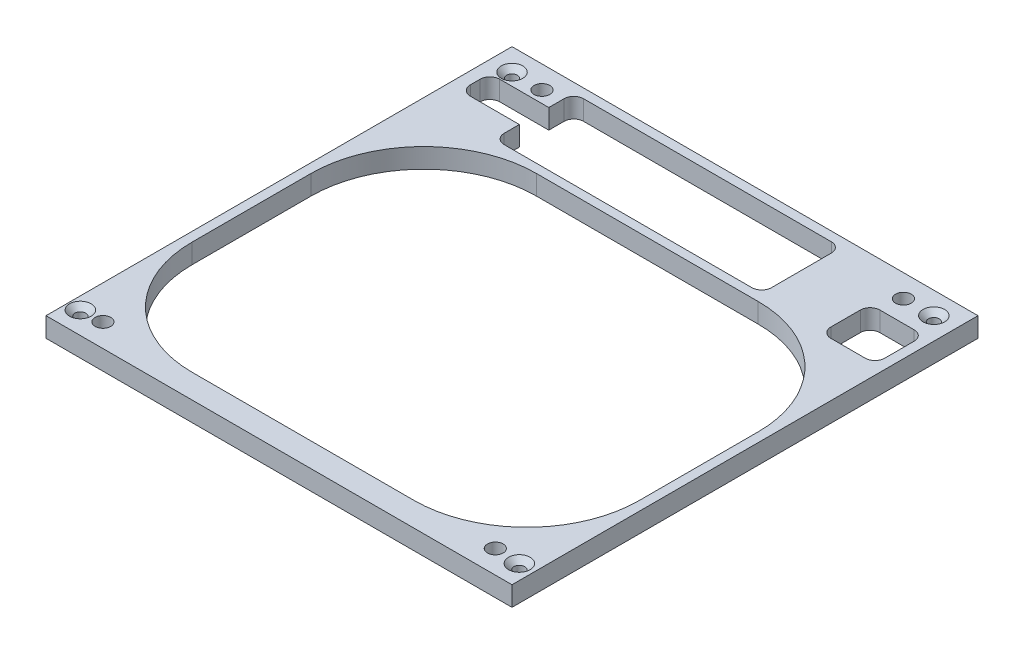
ISO-10303-21;
HEADER;
FILE_DESCRIPTION(('STEP AP214'),'2;1');
FILE_NAME('part.step','',(''),(''),'','','');
FILE_SCHEMA(('AUTOMOTIVE_DESIGN { 1 0 10303 214 1 1 1 1 }'));
ENDSEC;
DATA;
#1=APPLICATION_CONTEXT('core data for automotive mechanical design processes');
#2=APPLICATION_PROTOCOL_DEFINITION('international standard','automotive_design',2000,#1);
#3=PRODUCT_CONTEXT('',#1,'mechanical');
#4=PRODUCT('Part','Part','',(#3));
#5=PRODUCT_RELATED_PRODUCT_CATEGORY('part','',(#4));
#6=PRODUCT_DEFINITION_FORMATION('','',#4);
#7=PRODUCT_DEFINITION_CONTEXT('part definition',#1,'design');
#8=PRODUCT_DEFINITION('design','',#6,#7);
#9=PRODUCT_DEFINITION_SHAPE('','',#8);
#10=(LENGTH_UNIT() NAMED_UNIT(*) SI_UNIT(.MILLI.,.METRE.));
#11=(NAMED_UNIT(*) PLANE_ANGLE_UNIT() SI_UNIT($,.RADIAN.));
#12=(NAMED_UNIT(*) SI_UNIT($,.STERADIAN.) SOLID_ANGLE_UNIT());
#13=UNCERTAINTY_MEASURE_WITH_UNIT(LENGTH_MEASURE(1.E-05),#10,'distance_accuracy_value','');
#14=(GEOMETRIC_REPRESENTATION_CONTEXT(3) GLOBAL_UNCERTAINTY_ASSIGNED_CONTEXT((#13)) GLOBAL_UNIT_ASSIGNED_CONTEXT((#10,
#11,#12)) REPRESENTATION_CONTEXT('',''));
#15=CARTESIAN_POINT('',(0.,0.,0.));
#16=DIRECTION('',(0.,0.,1.));
#17=DIRECTION('',(1.,0.,0.));
#18=AXIS2_PLACEMENT_3D('',#15,#16,#17);
#19=CARTESIAN_POINT('',(0.,4.,0.));
#20=DIRECTION('',(0.,-1.,0.));
#21=DIRECTION('',(0.,0.,-1.));
#22=AXIS2_PLACEMENT_3D('',#19,#20,#21);
#23=PLANE('',#22);
#24=DIRECTION('',(0.,0.,-1.));
#25=VECTOR('',#24,1.);
#26=CARTESIAN_POINT('',(45.5,4.,-36.5));
#27=LINE('',#26,#25);
#28=CARTESIAN_POINT('',(45.5,4.,-30.5));
#29=VERTEX_POINT('',#28);
#30=CARTESIAN_POINT('',(45.5,4.,-36.5));
#31=VERTEX_POINT('',#30);
#32=EDGE_CURVE('E294',#29,#31,#27,.T.);
#33=ORIENTED_EDGE('',*,*,#32,.F.);
#34=CARTESIAN_POINT('',(43.5,4.,-30.5));
#35=DIRECTION('',(0.,1.,0.));
#36=DIRECTION('',(0.,0.,-1.));
#37=AXIS2_PLACEMENT_3D('',#34,#35,#36);
#38=CIRCLE('',#37,2.);
#39=CARTESIAN_POINT('',(43.5,4.,-28.5));
#40=VERTEX_POINT('',#39);
#41=EDGE_CURVE('E49',#40,#29,#38,.T.);
#42=ORIENTED_EDGE('',*,*,#41,.F.);
#43=DIRECTION('',(1.,0.,0.));
#44=VECTOR('',#43,1.);
#45=CARTESIAN_POINT('',(43.5,4.,-28.5));
#46=LINE('',#45,#44);
#47=CARTESIAN_POINT('',(36.5,4.,-28.5));
#48=VERTEX_POINT('',#47);
#49=EDGE_CURVE('E274',#48,#40,#46,.T.);
#50=ORIENTED_EDGE('',*,*,#49,.F.);
#51=CARTESIAN_POINT('',(36.5,4.,-30.5));
#52=DIRECTION('',(0.,1.,0.));
#53=DIRECTION('',(0.,0.,-1.));
#54=AXIS2_PLACEMENT_3D('',#51,#52,#53);
#55=CIRCLE('',#54,2.);
#56=CARTESIAN_POINT('',(34.5,4.,-30.5));
#57=VERTEX_POINT('',#56);
#58=EDGE_CURVE('E277',#57,#48,#55,.T.);
#59=ORIENTED_EDGE('',*,*,#58,.F.);
#60=DIRECTION('',(0.,0.,1.));
#61=VECTOR('',#60,1.);
#62=CARTESIAN_POINT('',(34.5,4.,-36.5));
#63=LINE('',#62,#61);
#64=CARTESIAN_POINT('',(34.5,4.,-36.5));
#65=VERTEX_POINT('',#64);
#66=EDGE_CURVE('E305',#65,#57,#63,.T.);
#67=ORIENTED_EDGE('',*,*,#66,.F.);
#68=CARTESIAN_POINT('',(36.5,4.,-36.5));
#69=DIRECTION('',(0.,1.,0.));
#70=DIRECTION('',(0.,0.,1.));
#71=AXIS2_PLACEMENT_3D('',#68,#69,#70);
#72=CIRCLE('',#71,2.);
#73=CARTESIAN_POINT('',(36.5,4.,-38.5));
#74=VERTEX_POINT('',#73);
#75=EDGE_CURVE('E302',#74,#65,#72,.T.);
#76=ORIENTED_EDGE('',*,*,#75,.F.);
#77=DIRECTION('',(-1.,0.,0.));
#78=VECTOR('',#77,1.);
#79=CARTESIAN_POINT('',(43.5,4.,-38.5));
#80=LINE('',#79,#78);
#81=CARTESIAN_POINT('',(43.5,4.,-38.5));
#82=VERTEX_POINT('',#81);
#83=EDGE_CURVE('E299',#82,#74,#80,.T.);
#84=ORIENTED_EDGE('',*,*,#83,.F.);
#85=CARTESIAN_POINT('',(43.5,4.,-36.5));
#86=DIRECTION('',(0.,1.,0.));
#87=DIRECTION('',(0.,0.,-1.));
#88=AXIS2_PLACEMENT_3D('',#85,#86,#87);
#89=CIRCLE('',#88,2.);
#90=EDGE_CURVE('E296',#31,#82,#89,.T.);
#91=ORIENTED_EDGE('',*,*,#90,.F.);
#92=EDGE_LOOP('',(#33,#42,#50,#59,#67,#76,#84,#91));
#93=FACE_BOUND('',#92,.T.);
#94=CARTESIAN_POINT('',(-43.,4.,-43.));
#95=DIRECTION('',(0.,1.,0.));
#96=DIRECTION('',(0.,0.,1.));
#97=AXIS2_PLACEMENT_3D('',#94,#95,#96);
#98=CIRCLE('',#97,2.2);
#99=CARTESIAN_POINT('',(-43.,4.,-40.8));
#100=VERTEX_POINT('',#99);
#101=EDGE_CURVE('E312',#100,#100,#98,.T.);
#102=ORIENTED_EDGE('',*,*,#101,.F.);
#103=EDGE_LOOP('',(#102));
#104=FACE_BOUND('',#103,.T.);
#105=CARTESIAN_POINT('',(43.,4.,-43.));
#106=DIRECTION('',(0.,1.,0.));
#107=DIRECTION('',(0.,0.,1.));
#108=AXIS2_PLACEMENT_3D('',#105,#106,#107);
#109=CIRCLE('',#108,2.2);
#110=CARTESIAN_POINT('',(43.,4.,-40.8));
#111=VERTEX_POINT('',#110);
#112=EDGE_CURVE('E332',#111,#111,#109,.T.);
#113=ORIENTED_EDGE('',*,*,#112,.F.);
#114=EDGE_LOOP('',(#113));
#115=FACE_BOUND('',#114,.T.);
#116=CARTESIAN_POINT('',(44.5,4.,43.));
#117=DIRECTION('',(0.,1.,0.));
#118=DIRECTION('',(0.,0.,1.));
#119=AXIS2_PLACEMENT_3D('',#116,#117,#118);
#120=CIRCLE('',#119,2.2);
#121=CARTESIAN_POINT('',(44.5,4.,45.2));
#122=VERTEX_POINT('',#121);
#123=EDGE_CURVE('E341',#122,#122,#120,.T.);
#124=ORIENTED_EDGE('',*,*,#123,.F.);
#125=EDGE_LOOP('',(#124));
#126=FACE_BOUND('',#125,.T.);
#127=DIRECTION('',(0.,0.,1.));
#128=VECTOR('',#127,1.);
#129=CARTESIAN_POINT('',(-47.5,4.,-47.5));
#130=LINE('',#129,#128);
#131=CARTESIAN_POINT('',(-47.5,4.,-47.5));
#132=VERTEX_POINT('',#131);
#133=CARTESIAN_POINT('',(-47.5,4.,47.5));
#134=VERTEX_POINT('',#133);
#135=EDGE_CURVE('E560',#132,#134,#130,.T.);
#136=ORIENTED_EDGE('',*,*,#135,.T.);
#137=DIRECTION('',(1.,0.,0.));
#138=VECTOR('',#137,1.);
#139=CARTESIAN_POINT('',(47.5,4.,47.5));
#140=LINE('',#139,#138);
#141=CARTESIAN_POINT('',(47.5,4.,47.5));
#142=VERTEX_POINT('',#141);
#143=EDGE_CURVE('E563',#134,#142,#140,.T.);
#144=ORIENTED_EDGE('',*,*,#143,.T.);
#145=DIRECTION('',(0.,0.,-1.));
#146=VECTOR('',#145,1.);
#147=CARTESIAN_POINT('',(47.5,4.,-47.5));
#148=LINE('',#147,#146);
#149=CARTESIAN_POINT('',(47.5,4.,-47.5));
#150=VERTEX_POINT('',#149);
#151=EDGE_CURVE('E566',#142,#150,#148,.T.);
#152=ORIENTED_EDGE('',*,*,#151,.T.);
#153=DIRECTION('',(-1.,0.,0.));
#154=VECTOR('',#153,1.);
#155=CARTESIAN_POINT('',(47.5,4.,-47.5));
#156=LINE('',#155,#154);
#157=EDGE_CURVE('E568',#150,#132,#156,.T.);
#158=ORIENTED_EDGE('',*,*,#157,.T.);
#159=EDGE_LOOP('',(#136,#144,#152,#158));
#160=FACE_BOUND('',#159,.T.);
#161=DIRECTION('',(1.,0.,0.));
#162=VECTOR('',#161,1.);
#163=CARTESIAN_POINT('',(-22.6,4.,42.6));
#164=LINE('',#163,#162);
#165=CARTESIAN_POINT('',(-22.6,4.,42.6));
#166=VERTEX_POINT('',#165);
#167=CARTESIAN_POINT('',(22.6,4.,42.6));
#168=VERTEX_POINT('',#167);
#169=EDGE_CURVE('E523',#166,#168,#164,.T.);
#170=ORIENTED_EDGE('',*,*,#169,.F.);
#171=CARTESIAN_POINT('',(-22.6,4.,19.6));
#172=DIRECTION('',(0.,1.,0.));
#173=DIRECTION('',(0.,0.,1.));
#174=AXIS2_PLACEMENT_3D('',#171,#172,#173);
#175=CIRCLE('',#174,23.);
#176=CARTESIAN_POINT('',(-45.6,4.,19.6));
#177=VERTEX_POINT('',#176);
#178=EDGE_CURVE('E469',#177,#166,#175,.T.);
#179=ORIENTED_EDGE('',*,*,#178,.F.);
#180=DIRECTION('',(0.,0.,1.));
#181=VECTOR('',#180,1.);
#182=CARTESIAN_POINT('',(-45.6,4.,-4.60000000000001));
#183=LINE('',#182,#181);
#184=CARTESIAN_POINT('',(-45.6,4.,-4.60000000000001));
#185=VERTEX_POINT('',#184);
#186=EDGE_CURVE('E500',#185,#177,#183,.T.);
#187=ORIENTED_EDGE('',*,*,#186,.F.);
#188=CARTESIAN_POINT('',(-22.6,4.,-4.60000000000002));
#189=DIRECTION('',(0.,1.,0.));
#190=DIRECTION('',(0.,0.,-1.));
#191=AXIS2_PLACEMENT_3D('',#188,#189,#190);
#192=CIRCLE('',#191,23.);
#193=CARTESIAN_POINT('',(-22.6,4.,-27.6));
#194=VERTEX_POINT('',#193);
#195=EDGE_CURVE('E538',#194,#185,#192,.T.);
#196=ORIENTED_EDGE('',*,*,#195,.F.);
#197=DIRECTION('',(-1.,0.,0.));
#198=VECTOR('',#197,1.);
#199=CARTESIAN_POINT('',(-22.6,4.,-27.6));
#200=LINE('',#199,#198);
#201=CARTESIAN_POINT('',(22.6,4.,-27.6));
#202=VERTEX_POINT('',#201);
#203=EDGE_CURVE('E535',#202,#194,#200,.T.);
#204=ORIENTED_EDGE('',*,*,#203,.F.);
#205=CARTESIAN_POINT('',(22.6,4.,-4.60000000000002));
#206=DIRECTION('',(0.,1.,0.));
#207=DIRECTION('',(0.,0.,-1.));
#208=AXIS2_PLACEMENT_3D('',#205,#206,#207);
#209=CIRCLE('',#208,23.);
#210=CARTESIAN_POINT('',(45.6,4.,-4.60000000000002));
#211=VERTEX_POINT('',#210);
#212=EDGE_CURVE('E532',#211,#202,#209,.T.);
#213=ORIENTED_EDGE('',*,*,#212,.F.);
#214=DIRECTION('',(0.,0.,-1.));
#215=VECTOR('',#214,1.);
#216=CARTESIAN_POINT('',(45.6,4.,-4.60000000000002));
#217=LINE('',#216,#215);
#218=CARTESIAN_POINT('',(45.6,4.,19.6));
#219=VERTEX_POINT('',#218);
#220=EDGE_CURVE('E529',#219,#211,#217,.T.);
#221=ORIENTED_EDGE('',*,*,#220,.F.);
#222=CARTESIAN_POINT('',(22.6,4.,19.6));
#223=DIRECTION('',(0.,1.,0.));
#224=DIRECTION('',(0.,0.,1.));
#225=AXIS2_PLACEMENT_3D('',#222,#223,#224);
#226=CIRCLE('',#225,23.);
#227=EDGE_CURVE('E526',#168,#219,#226,.T.);
#228=ORIENTED_EDGE('',*,*,#227,.F.);
#229=EDGE_LOOP('',(#170,#179,#187,#196,#204,#213,#221,#228));
#230=FACE_BOUND('',#229,.T.);
#231=DIRECTION('',(0.,0.,1.));
#232=VECTOR('',#231,1.);
#233=CARTESIAN_POINT('',(-45.,4.,-38.5));
#234=LINE('',#233,#232);
#235=CARTESIAN_POINT('',(-45.,4.,-38.5));
#236=VERTEX_POINT('',#235);
#237=CARTESIAN_POINT('',(-45.,4.,-36.5));
#238=VERTEX_POINT('',#237);
#239=EDGE_CURVE('E429',#236,#238,#234,.T.);
#240=ORIENTED_EDGE('',*,*,#239,.F.);
#241=CARTESIAN_POINT('',(-43.,4.,-38.5));
#242=DIRECTION('',(0.,1.,0.));
#243=DIRECTION('',(0.,0.,1.));
#244=AXIS2_PLACEMENT_3D('',#241,#242,#243);
#245=CIRCLE('',#244,2.);
#246=CARTESIAN_POINT('',(-43.,4.,-40.5));
#247=VERTEX_POINT('',#246);
#248=EDGE_CURVE('E383',#247,#236,#245,.T.);
#249=ORIENTED_EDGE('',*,*,#248,.F.);
#250=DIRECTION('',(-1.,0.,0.));
#251=VECTOR('',#250,1.);
#252=CARTESIAN_POINT('',(-33.,4.,-40.5));
#253=LINE('',#252,#251);
#254=CARTESIAN_POINT('',(-33.,4.,-40.5));
#255=VERTEX_POINT('',#254);
#256=EDGE_CURVE('E388',#255,#247,#253,.T.);
#257=ORIENTED_EDGE('',*,*,#256,.F.);
#258=DIRECTION('',(0.,0.,1.));
#259=VECTOR('',#258,1.);
#260=CARTESIAN_POINT('',(-33.,4.,-43.6));
#261=LINE('',#260,#259);
#262=CARTESIAN_POINT('',(-33.,4.,-43.6));
#263=VERTEX_POINT('',#262);
#264=EDGE_CURVE('E462',#263,#255,#261,.T.);
#265=ORIENTED_EDGE('',*,*,#264,.F.);
#266=CARTESIAN_POINT('',(-31.,4.,-43.6));
#267=DIRECTION('',(0.,1.,0.));
#268=DIRECTION('',(0.,0.,-1.));
#269=AXIS2_PLACEMENT_3D('',#266,#267,#268);
#270=CIRCLE('',#269,2.);
#271=CARTESIAN_POINT('',(-31.,4.,-45.6));
#272=VERTEX_POINT('',#271);
#273=EDGE_CURVE('E459',#272,#263,#270,.T.);
#274=ORIENTED_EDGE('',*,*,#273,.F.);
#275=DIRECTION('',(-1.,0.,0.));
#276=VECTOR('',#275,1.);
#277=CARTESIAN_POINT('',(-31.,4.,-45.6));
#278=LINE('',#277,#276);
#279=CARTESIAN_POINT('',(19.5,4.,-45.6));
#280=VERTEX_POINT('',#279);
#281=EDGE_CURVE('E456',#280,#272,#278,.T.);
#282=ORIENTED_EDGE('',*,*,#281,.F.);
#283=CARTESIAN_POINT('',(19.5,4.,-43.6));
#284=DIRECTION('',(0.,1.,0.));
#285=DIRECTION('',(0.,0.,-1.));
#286=AXIS2_PLACEMENT_3D('',#283,#284,#285);
#287=CIRCLE('',#286,2.);
#288=CARTESIAN_POINT('',(21.5,4.,-43.6));
#289=VERTEX_POINT('',#288);
#290=EDGE_CURVE('E453',#289,#280,#287,.T.);
#291=ORIENTED_EDGE('',*,*,#290,.F.);
#292=DIRECTION('',(0.,0.,-1.));
#293=VECTOR('',#292,1.);
#294=CARTESIAN_POINT('',(21.5,4.,-43.6));
#295=LINE('',#294,#293);
#296=CARTESIAN_POINT('',(21.5,4.,-31.4));
#297=VERTEX_POINT('',#296);
#298=EDGE_CURVE('E450',#297,#289,#295,.T.);
#299=ORIENTED_EDGE('',*,*,#298,.F.);
#300=CARTESIAN_POINT('',(19.5,4.,-31.4));
#301=DIRECTION('',(0.,1.,0.));
#302=DIRECTION('',(0.,0.,1.));
#303=AXIS2_PLACEMENT_3D('',#300,#301,#302);
#304=CIRCLE('',#303,2.);
#305=CARTESIAN_POINT('',(19.5,4.,-29.4));
#306=VERTEX_POINT('',#305);
#307=EDGE_CURVE('E447',#306,#297,#304,.T.);
#308=ORIENTED_EDGE('',*,*,#307,.F.);
#309=DIRECTION('',(1.,0.,0.));
#310=VECTOR('',#309,1.);
#311=CARTESIAN_POINT('',(-31.,4.,-29.4));
#312=LINE('',#311,#310);
#313=CARTESIAN_POINT('',(-31.,4.,-29.4));
#314=VERTEX_POINT('',#313);
#315=EDGE_CURVE('E444',#314,#306,#312,.T.);
#316=ORIENTED_EDGE('',*,*,#315,.F.);
#317=CARTESIAN_POINT('',(-31.,4.,-31.4));
#318=DIRECTION('',(0.,1.,0.));
#319=DIRECTION('',(0.,0.,1.));
#320=AXIS2_PLACEMENT_3D('',#317,#318,#319);
#321=CIRCLE('',#320,2.);
#322=CARTESIAN_POINT('',(-33.,4.,-31.4));
#323=VERTEX_POINT('',#322);
#324=EDGE_CURVE('E441',#323,#314,#321,.T.);
#325=ORIENTED_EDGE('',*,*,#324,.F.);
#326=DIRECTION('',(0.,0.,1.));
#327=VECTOR('',#326,1.);
#328=CARTESIAN_POINT('',(-33.,4.,-31.4));
#329=LINE('',#328,#327);
#330=CARTESIAN_POINT('',(-33.,4.,-34.5));
#331=VERTEX_POINT('',#330);
#332=EDGE_CURVE('E438',#331,#323,#329,.T.);
#333=ORIENTED_EDGE('',*,*,#332,.F.);
#334=DIRECTION('',(1.,0.,0.));
#335=VECTOR('',#334,1.);
#336=CARTESIAN_POINT('',(-33.,4.,-34.5));
#337=LINE('',#336,#335);
#338=CARTESIAN_POINT('',(-43.,4.,-34.5));
#339=VERTEX_POINT('',#338);
#340=EDGE_CURVE('E435',#339,#331,#337,.T.);
#341=ORIENTED_EDGE('',*,*,#340,.F.);
#342=CARTESIAN_POINT('',(-43.,4.,-36.5));
#343=DIRECTION('',(0.,1.,0.));
#344=DIRECTION('',(0.,0.,-1.));
#345=AXIS2_PLACEMENT_3D('',#342,#343,#344);
#346=CIRCLE('',#345,2.);
#347=EDGE_CURVE('E432',#238,#339,#346,.T.);
#348=ORIENTED_EDGE('',*,*,#347,.F.);
#349=EDGE_LOOP('',(#240,#249,#257,#265,#274,#282,#291,#299,#308,#316,#325,#333,#341,#348));
#350=FACE_BOUND('',#349,.T.);
#351=CARTESIAN_POINT('',(-40.6,4.,42.8));
#352=DIRECTION('',(0.,1.,0.));
#353=DIRECTION('',(0.,0.,1.));
#354=AXIS2_PLACEMENT_3D('',#351,#352,#353);
#355=CIRCLE('',#354,1.6);
#356=CARTESIAN_POINT('',(-40.6,4.,44.4));
#357=VERTEX_POINT('',#356);
#358=EDGE_CURVE('E377',#357,#357,#355,.T.);
#359=ORIENTED_EDGE('',*,*,#358,.F.);
#360=EDGE_LOOP('',(#359));
#361=FACE_BOUND('',#360,.T.);
#362=CARTESIAN_POINT('',(39.4,4.,42.8));
#363=DIRECTION('',(0.,1.,0.));
#364=DIRECTION('',(0.,0.,1.));
#365=AXIS2_PLACEMENT_3D('',#362,#363,#364);
#366=CIRCLE('',#365,1.6);
#367=CARTESIAN_POINT('',(39.4,4.,44.4));
#368=VERTEX_POINT('',#367);
#369=EDGE_CURVE('E371',#368,#368,#366,.T.);
#370=ORIENTED_EDGE('',*,*,#369,.F.);
#371=EDGE_LOOP('',(#370));
#372=FACE_BOUND('',#371,.T.);
#373=CARTESIAN_POINT('',(36.9,4.,-42.9));
#374=DIRECTION('',(0.,1.,0.));
#375=DIRECTION('',(0.,0.,1.));
#376=AXIS2_PLACEMENT_3D('',#373,#374,#375);
#377=CIRCLE('',#376,1.6);
#378=CARTESIAN_POINT('',(36.9,4.,-41.3));
#379=VERTEX_POINT('',#378);
#380=EDGE_CURVE('E365',#379,#379,#377,.T.);
#381=ORIENTED_EDGE('',*,*,#380,.F.);
#382=EDGE_LOOP('',(#381));
#383=FACE_BOUND('',#382,.T.);
#384=CARTESIAN_POINT('',(-36.8,4.,-42.9));
#385=DIRECTION('',(0.,1.,0.));
#386=DIRECTION('',(0.,0.,1.));
#387=AXIS2_PLACEMENT_3D('',#384,#385,#386);
#388=CIRCLE('',#387,1.6);
#389=CARTESIAN_POINT('',(-36.8,4.,-41.3));
#390=VERTEX_POINT('',#389);
#391=EDGE_CURVE('E359',#390,#390,#388,.T.);
#392=ORIENTED_EDGE('',*,*,#391,.F.);
#393=EDGE_LOOP('',(#392));
#394=FACE_BOUND('',#393,.T.);
#395=CARTESIAN_POINT('',(-45.,4.,43.));
#396=DIRECTION('',(0.,1.,0.));
#397=DIRECTION('',(0.,0.,1.));
#398=AXIS2_PLACEMENT_3D('',#395,#396,#397);
#399=CIRCLE('',#398,2.2);
#400=CARTESIAN_POINT('',(-45.,4.,45.2));
#401=VERTEX_POINT('',#400);
#402=EDGE_CURVE('E350',#401,#401,#399,.T.);
#403=ORIENTED_EDGE('',*,*,#402,.F.);
#404=EDGE_LOOP('',(#403));
#405=FACE_BOUND('',#404,.T.);
#406=ADVANCED_FACE('F34',(#93,#104,#115,#126,#160,#230,#350,#361,#372,#383,#394,#405),#23,.F.);
#407=CARTESIAN_POINT('',(0.,0.,0.));
#408=DIRECTION('',(0.,-1.,0.));
#409=DIRECTION('',(0.,0.,-1.));
#410=AXIS2_PLACEMENT_3D('',#407,#408,#409);
#411=PLANE('',#410);
#412=CARTESIAN_POINT('',(43.5,0.,-30.5));
#413=DIRECTION('',(0.,1.,0.));
#414=DIRECTION('',(0.,0.,-1.));
#415=AXIS2_PLACEMENT_3D('',#412,#413,#414);
#416=CIRCLE('',#415,2.);
#417=CARTESIAN_POINT('',(43.5,0.,-28.5));
#418=VERTEX_POINT('',#417);
#419=CARTESIAN_POINT('',(45.5,0.,-30.5));
#420=VERTEX_POINT('',#419);
#421=EDGE_CURVE('E257',#418,#420,#416,.T.);
#422=ORIENTED_EDGE('',*,*,#421,.T.);
#423=DIRECTION('',(0.,0.,-1.));
#424=VECTOR('',#423,1.);
#425=CARTESIAN_POINT('',(45.5,0.,-36.5));
#426=LINE('',#425,#424);
#427=CARTESIAN_POINT('',(45.5,0.,-36.5));
#428=VERTEX_POINT('',#427);
#429=EDGE_CURVE('E266',#420,#428,#426,.T.);
#430=ORIENTED_EDGE('',*,*,#429,.T.);
#431=CARTESIAN_POINT('',(43.5,0.,-36.5));
#432=DIRECTION('',(0.,1.,0.));
#433=DIRECTION('',(0.,0.,-1.));
#434=AXIS2_PLACEMENT_3D('',#431,#432,#433);
#435=CIRCLE('',#434,2.);
#436=CARTESIAN_POINT('',(43.5,0.,-38.5));
#437=VERTEX_POINT('',#436);
#438=EDGE_CURVE('E57',#428,#437,#435,.T.);
#439=ORIENTED_EDGE('',*,*,#438,.T.);
#440=DIRECTION('',(-1.,0.,0.));
#441=VECTOR('',#440,1.);
#442=CARTESIAN_POINT('',(43.5,0.,-38.5));
#443=LINE('',#442,#441);
#444=CARTESIAN_POINT('',(36.5,0.,-38.5));
#445=VERTEX_POINT('',#444);
#446=EDGE_CURVE('E281',#437,#445,#443,.T.);
#447=ORIENTED_EDGE('',*,*,#446,.T.);
#448=CARTESIAN_POINT('',(36.5,0.,-36.5));
#449=DIRECTION('',(0.,1.,0.));
#450=DIRECTION('',(0.,0.,1.));
#451=AXIS2_PLACEMENT_3D('',#448,#449,#450);
#452=CIRCLE('',#451,2.);
#453=CARTESIAN_POINT('',(34.5,0.,-36.5));
#454=VERTEX_POINT('',#453);
#455=EDGE_CURVE('E284',#445,#454,#452,.T.);
#456=ORIENTED_EDGE('',*,*,#455,.T.);
#457=DIRECTION('',(0.,0.,1.));
#458=VECTOR('',#457,1.);
#459=CARTESIAN_POINT('',(34.5,0.,-36.5));
#460=LINE('',#459,#458);
#461=CARTESIAN_POINT('',(34.5,0.,-30.5));
#462=VERTEX_POINT('',#461);
#463=EDGE_CURVE('E287',#454,#462,#460,.T.);
#464=ORIENTED_EDGE('',*,*,#463,.T.);
#465=CARTESIAN_POINT('',(36.5,0.,-30.5));
#466=DIRECTION('',(0.,1.,0.));
#467=DIRECTION('',(0.,0.,-1.));
#468=AXIS2_PLACEMENT_3D('',#465,#466,#467);
#469=CIRCLE('',#468,2.);
#470=CARTESIAN_POINT('',(36.5,0.,-28.5));
#471=VERTEX_POINT('',#470);
#472=EDGE_CURVE('E290',#462,#471,#469,.T.);
#473=ORIENTED_EDGE('',*,*,#472,.T.);
#474=DIRECTION('',(1.,0.,0.));
#475=VECTOR('',#474,1.);
#476=CARTESIAN_POINT('',(43.5,0.,-28.5));
#477=LINE('',#476,#475);
#478=EDGE_CURVE('E263',#471,#418,#477,.T.);
#479=ORIENTED_EDGE('',*,*,#478,.T.);
#480=EDGE_LOOP('',(#422,#430,#439,#447,#456,#464,#473,#479));
#481=FACE_BOUND('',#480,.T.);
#482=CARTESIAN_POINT('',(-43.,0.,-43.));
#483=DIRECTION('',(0.,1.,0.));
#484=DIRECTION('',(0.,0.,1.));
#485=AXIS2_PLACEMENT_3D('',#482,#483,#484);
#486=CIRCLE('',#485,1.1);
#487=CARTESIAN_POINT('',(-43.,0.,-41.9));
#488=VERTEX_POINT('',#487);
#489=EDGE_CURVE('E329',#488,#488,#486,.T.);
#490=ORIENTED_EDGE('',*,*,#489,.T.);
#491=EDGE_LOOP('',(#490));
#492=FACE_BOUND('',#491,.T.);
#493=CARTESIAN_POINT('',(43.,0.,-43.));
#494=DIRECTION('',(0.,1.,0.));
#495=DIRECTION('',(0.,0.,1.));
#496=AXIS2_PLACEMENT_3D('',#493,#494,#495);
#497=CIRCLE('',#496,1.1);
#498=CARTESIAN_POINT('',(43.,0.,-41.9));
#499=VERTEX_POINT('',#498);
#500=EDGE_CURVE('E338',#499,#499,#497,.T.);
#501=ORIENTED_EDGE('',*,*,#500,.T.);
#502=EDGE_LOOP('',(#501));
#503=FACE_BOUND('',#502,.T.);
#504=CARTESIAN_POINT('',(44.5,0.,43.));
#505=DIRECTION('',(0.,1.,0.));
#506=DIRECTION('',(0.,0.,1.));
#507=AXIS2_PLACEMENT_3D('',#504,#505,#506);
#508=CIRCLE('',#507,1.1);
#509=CARTESIAN_POINT('',(44.5,0.,44.1));
#510=VERTEX_POINT('',#509);
#511=EDGE_CURVE('E347',#510,#510,#508,.T.);
#512=ORIENTED_EDGE('',*,*,#511,.T.);
#513=EDGE_LOOP('',(#512));
#514=FACE_BOUND('',#513,.T.);
#515=DIRECTION('',(0.,0.,1.));
#516=VECTOR('',#515,1.);
#517=CARTESIAN_POINT('',(-47.5,0.,-47.5));
#518=LINE('',#517,#516);
#519=CARTESIAN_POINT('',(-47.5,0.,-47.5));
#520=VERTEX_POINT('',#519);
#521=CARTESIAN_POINT('',(-47.5,0.,47.5));
#522=VERTEX_POINT('',#521);
#523=EDGE_CURVE('E545',#520,#522,#518,.T.);
#524=ORIENTED_EDGE('',*,*,#523,.F.);
#525=DIRECTION('',(-1.,0.,0.));
#526=VECTOR('',#525,1.);
#527=CARTESIAN_POINT('',(47.5,0.,-47.5));
#528=LINE('',#527,#526);
#529=CARTESIAN_POINT('',(47.5,0.,-47.5));
#530=VERTEX_POINT('',#529);
#531=EDGE_CURVE('E564',#530,#520,#528,.T.);
#532=ORIENTED_EDGE('',*,*,#531,.F.);
#533=DIRECTION('',(0.,0.,-1.));
#534=VECTOR('',#533,1.);
#535=CARTESIAN_POINT('',(47.5,0.,-47.5));
#536=LINE('',#535,#534);
#537=CARTESIAN_POINT('',(47.5,0.,47.5));
#538=VERTEX_POINT('',#537);
#539=EDGE_CURVE('E575',#538,#530,#536,.T.);
#540=ORIENTED_EDGE('',*,*,#539,.F.);
#541=DIRECTION('',(1.,0.,0.));
#542=VECTOR('',#541,1.);
#543=CARTESIAN_POINT('',(47.5,0.,47.5));
#544=LINE('',#543,#542);
#545=EDGE_CURVE('E573',#522,#538,#544,.T.);
#546=ORIENTED_EDGE('',*,*,#545,.F.);
#547=EDGE_LOOP('',(#524,#532,#540,#546));
#548=FACE_BOUND('',#547,.T.);
#549=CARTESIAN_POINT('',(-22.6,0.,19.6));
#550=DIRECTION('',(0.,1.,0.));
#551=DIRECTION('',(0.,0.,1.));
#552=AXIS2_PLACEMENT_3D('',#549,#550,#551);
#553=CIRCLE('',#552,23.);
#554=CARTESIAN_POINT('',(-45.6,0.,19.6));
#555=VERTEX_POINT('',#554);
#556=CARTESIAN_POINT('',(-22.6,0.,42.6));
#557=VERTEX_POINT('',#556);
#558=EDGE_CURVE('E496',#555,#557,#553,.T.);
#559=ORIENTED_EDGE('',*,*,#558,.T.);
#560=DIRECTION('',(1.,0.,0.));
#561=VECTOR('',#560,1.);
#562=CARTESIAN_POINT('',(-22.6,0.,42.6));
#563=LINE('',#562,#561);
#564=CARTESIAN_POINT('',(22.6,0.,42.6));
#565=VERTEX_POINT('',#564);
#566=EDGE_CURVE('E499',#557,#565,#563,.T.);
#567=ORIENTED_EDGE('',*,*,#566,.T.);
#568=CARTESIAN_POINT('',(22.6,0.,19.6));
#569=DIRECTION('',(0.,1.,0.));
#570=DIRECTION('',(0.,0.,1.));
#571=AXIS2_PLACEMENT_3D('',#568,#569,#570);
#572=CIRCLE('',#571,23.);
#573=CARTESIAN_POINT('',(45.6,0.,19.6));
#574=VERTEX_POINT('',#573);
#575=EDGE_CURVE('E503',#565,#574,#572,.T.);
#576=ORIENTED_EDGE('',*,*,#575,.T.);
#577=DIRECTION('',(0.,0.,-1.));
#578=VECTOR('',#577,1.);
#579=CARTESIAN_POINT('',(45.6,0.,-4.60000000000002));
#580=LINE('',#579,#578);
#581=CARTESIAN_POINT('',(45.6,0.,-4.60000000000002));
#582=VERTEX_POINT('',#581);
#583=EDGE_CURVE('E506',#574,#582,#580,.T.);
#584=ORIENTED_EDGE('',*,*,#583,.T.);
#585=CARTESIAN_POINT('',(22.6,0.,-4.60000000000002));
#586=DIRECTION('',(0.,1.,0.));
#587=DIRECTION('',(0.,0.,-1.));
#588=AXIS2_PLACEMENT_3D('',#585,#586,#587);
#589=CIRCLE('',#588,23.);
#590=CARTESIAN_POINT('',(22.6,0.,-27.6));
#591=VERTEX_POINT('',#590);
#592=EDGE_CURVE('E509',#582,#591,#589,.T.);
#593=ORIENTED_EDGE('',*,*,#592,.T.);
#594=DIRECTION('',(-1.,0.,0.));
#595=VECTOR('',#594,1.);
#596=CARTESIAN_POINT('',(-22.6,0.,-27.6));
#597=LINE('',#596,#595);
#598=CARTESIAN_POINT('',(-22.6,0.,-27.6));
#599=VERTEX_POINT('',#598);
#600=EDGE_CURVE('E512',#591,#599,#597,.T.);
#601=ORIENTED_EDGE('',*,*,#600,.T.);
#602=CARTESIAN_POINT('',(-22.6,0.,-4.60000000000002));
#603=DIRECTION('',(0.,1.,0.));
#604=DIRECTION('',(0.,0.,-1.));
#605=AXIS2_PLACEMENT_3D('',#602,#603,#604);
#606=CIRCLE('',#605,23.);
#607=CARTESIAN_POINT('',(-45.6,0.,-4.60000000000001));
#608=VERTEX_POINT('',#607);
#609=EDGE_CURVE('E515',#599,#608,#606,.T.);
#610=ORIENTED_EDGE('',*,*,#609,.T.);
#611=DIRECTION('',(0.,0.,1.));
#612=VECTOR('',#611,1.);
#613=CARTESIAN_POINT('',(-45.6,0.,-4.60000000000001));
#614=LINE('',#613,#612);
#615=EDGE_CURVE('E518',#608,#555,#614,.T.);
#616=ORIENTED_EDGE('',*,*,#615,.T.);
#617=EDGE_LOOP('',(#559,#567,#576,#584,#593,#601,#610,#616));
#618=FACE_BOUND('',#617,.T.);
#619=CARTESIAN_POINT('',(-43.,0.,-38.5));
#620=DIRECTION('',(0.,1.,0.));
#621=DIRECTION('',(0.,0.,1.));
#622=AXIS2_PLACEMENT_3D('',#619,#620,#621);
#623=CIRCLE('',#622,2.);
#624=CARTESIAN_POINT('',(-43.,0.,-40.5));
#625=VERTEX_POINT('',#624);
#626=CARTESIAN_POINT('',(-45.,0.,-38.5));
#627=VERTEX_POINT('',#626);
#628=EDGE_CURVE('E384',#625,#627,#623,.T.);
#629=ORIENTED_EDGE('',*,*,#628,.T.);
#630=DIRECTION('',(0.,0.,1.));
#631=VECTOR('',#630,1.);
#632=CARTESIAN_POINT('',(-45.,0.,-38.5));
#633=LINE('',#632,#631);
#634=CARTESIAN_POINT('',(-45.,0.,-36.5));
#635=VERTEX_POINT('',#634);
#636=EDGE_CURVE('E387',#627,#635,#633,.T.);
#637=ORIENTED_EDGE('',*,*,#636,.T.);
#638=CARTESIAN_POINT('',(-43.,0.,-36.5));
#639=DIRECTION('',(0.,1.,0.));
#640=DIRECTION('',(0.,0.,-1.));
#641=AXIS2_PLACEMENT_3D('',#638,#639,#640);
#642=CIRCLE('',#641,2.);
#643=CARTESIAN_POINT('',(-43.,0.,-34.5));
#644=VERTEX_POINT('',#643);
#645=EDGE_CURVE('E391',#635,#644,#642,.T.);
#646=ORIENTED_EDGE('',*,*,#645,.T.);
#647=DIRECTION('',(1.,0.,0.));
#648=VECTOR('',#647,1.);
#649=CARTESIAN_POINT('',(-33.,0.,-34.5));
#650=LINE('',#649,#648);
#651=CARTESIAN_POINT('',(-33.,0.,-34.5));
#652=VERTEX_POINT('',#651);
#653=EDGE_CURVE('E394',#644,#652,#650,.T.);
#654=ORIENTED_EDGE('',*,*,#653,.T.);
#655=DIRECTION('',(0.,0.,1.));
#656=VECTOR('',#655,1.);
#657=CARTESIAN_POINT('',(-33.,0.,-31.4));
#658=LINE('',#657,#656);
#659=CARTESIAN_POINT('',(-33.,0.,-31.4));
#660=VERTEX_POINT('',#659);
#661=EDGE_CURVE('E397',#652,#660,#658,.T.);
#662=ORIENTED_EDGE('',*,*,#661,.T.);
#663=CARTESIAN_POINT('',(-31.,0.,-31.4));
#664=DIRECTION('',(0.,1.,0.));
#665=DIRECTION('',(0.,0.,1.));
#666=AXIS2_PLACEMENT_3D('',#663,#664,#665);
#667=CIRCLE('',#666,2.);
#668=CARTESIAN_POINT('',(-31.,0.,-29.4));
#669=VERTEX_POINT('',#668);
#670=EDGE_CURVE('E400',#660,#669,#667,.T.);
#671=ORIENTED_EDGE('',*,*,#670,.T.);
#672=DIRECTION('',(1.,0.,0.));
#673=VECTOR('',#672,1.);
#674=CARTESIAN_POINT('',(-31.,0.,-29.4));
#675=LINE('',#674,#673);
#676=CARTESIAN_POINT('',(19.5,0.,-29.4));
#677=VERTEX_POINT('',#676);
#678=EDGE_CURVE('E403',#669,#677,#675,.T.);
#679=ORIENTED_EDGE('',*,*,#678,.T.);
#680=CARTESIAN_POINT('',(19.5,0.,-31.4));
#681=DIRECTION('',(0.,1.,0.));
#682=DIRECTION('',(0.,0.,1.));
#683=AXIS2_PLACEMENT_3D('',#680,#681,#682);
#684=CIRCLE('',#683,2.);
#685=CARTESIAN_POINT('',(21.5,0.,-31.4));
#686=VERTEX_POINT('',#685);
#687=EDGE_CURVE('E406',#677,#686,#684,.T.);
#688=ORIENTED_EDGE('',*,*,#687,.T.);
#689=DIRECTION('',(0.,0.,-1.));
#690=VECTOR('',#689,1.);
#691=CARTESIAN_POINT('',(21.5,0.,-43.6));
#692=LINE('',#691,#690);
#693=CARTESIAN_POINT('',(21.5,0.,-43.6));
#694=VERTEX_POINT('',#693);
#695=EDGE_CURVE('E409',#686,#694,#692,.T.);
#696=ORIENTED_EDGE('',*,*,#695,.T.);
#697=CARTESIAN_POINT('',(19.5,0.,-43.6));
#698=DIRECTION('',(0.,1.,0.));
#699=DIRECTION('',(0.,0.,-1.));
#700=AXIS2_PLACEMENT_3D('',#697,#698,#699);
#701=CIRCLE('',#700,2.);
#702=CARTESIAN_POINT('',(19.5,0.,-45.6));
#703=VERTEX_POINT('',#702);
#704=EDGE_CURVE('E412',#694,#703,#701,.T.);
#705=ORIENTED_EDGE('',*,*,#704,.T.);
#706=DIRECTION('',(-1.,0.,0.));
#707=VECTOR('',#706,1.);
#708=CARTESIAN_POINT('',(-31.,0.,-45.6));
#709=LINE('',#708,#707);
#710=CARTESIAN_POINT('',(-31.,0.,-45.6));
#711=VERTEX_POINT('',#710);
#712=EDGE_CURVE('E415',#703,#711,#709,.T.);
#713=ORIENTED_EDGE('',*,*,#712,.T.);
#714=CARTESIAN_POINT('',(-31.,0.,-43.6));
#715=DIRECTION('',(0.,1.,0.));
#716=DIRECTION('',(0.,0.,-1.));
#717=AXIS2_PLACEMENT_3D('',#714,#715,#716);
#718=CIRCLE('',#717,2.);
#719=CARTESIAN_POINT('',(-33.,0.,-43.6));
#720=VERTEX_POINT('',#719);
#721=EDGE_CURVE('E418',#711,#720,#718,.T.);
#722=ORIENTED_EDGE('',*,*,#721,.T.);
#723=DIRECTION('',(0.,0.,1.));
#724=VECTOR('',#723,1.);
#725=CARTESIAN_POINT('',(-33.,0.,-43.6));
#726=LINE('',#725,#724);
#727=CARTESIAN_POINT('',(-33.,0.,-40.5));
#728=VERTEX_POINT('',#727);
#729=EDGE_CURVE('E421',#720,#728,#726,.T.);
#730=ORIENTED_EDGE('',*,*,#729,.T.);
#731=DIRECTION('',(-1.,0.,0.));
#732=VECTOR('',#731,1.);
#733=CARTESIAN_POINT('',(-33.,0.,-40.5));
#734=LINE('',#733,#732);
#735=EDGE_CURVE('E424',#728,#625,#734,.T.);
#736=ORIENTED_EDGE('',*,*,#735,.T.);
#737=EDGE_LOOP('',(#629,#637,#646,#654,#662,#671,#679,#688,#696,#705,#713,#722,#730,#736));
#738=FACE_BOUND('',#737,.T.);
#739=CARTESIAN_POINT('',(-40.6,0.,42.8));
#740=DIRECTION('',(0.,1.,0.));
#741=DIRECTION('',(0.,0.,1.));
#742=AXIS2_PLACEMENT_3D('',#739,#740,#741);
#743=CIRCLE('',#742,1.6);
#744=CARTESIAN_POINT('',(-40.6,0.,44.4));
#745=VERTEX_POINT('',#744);
#746=EDGE_CURVE('E380',#745,#745,#743,.T.);
#747=ORIENTED_EDGE('',*,*,#746,.T.);
#748=EDGE_LOOP('',(#747));
#749=FACE_BOUND('',#748,.T.);
#750=CARTESIAN_POINT('',(39.4,0.,42.8));
#751=DIRECTION('',(0.,1.,0.));
#752=DIRECTION('',(0.,0.,1.));
#753=AXIS2_PLACEMENT_3D('',#750,#751,#752);
#754=CIRCLE('',#753,1.6);
#755=CARTESIAN_POINT('',(39.4,0.,44.4));
#756=VERTEX_POINT('',#755);
#757=EDGE_CURVE('E374',#756,#756,#754,.T.);
#758=ORIENTED_EDGE('',*,*,#757,.T.);
#759=EDGE_LOOP('',(#758));
#760=FACE_BOUND('',#759,.T.);
#761=CARTESIAN_POINT('',(36.9,0.,-42.9));
#762=DIRECTION('',(0.,1.,0.));
#763=DIRECTION('',(0.,0.,1.));
#764=AXIS2_PLACEMENT_3D('',#761,#762,#763);
#765=CIRCLE('',#764,1.6);
#766=CARTESIAN_POINT('',(36.9,0.,-41.3));
#767=VERTEX_POINT('',#766);
#768=EDGE_CURVE('E368',#767,#767,#765,.T.);
#769=ORIENTED_EDGE('',*,*,#768,.T.);
#770=EDGE_LOOP('',(#769));
#771=FACE_BOUND('',#770,.T.);
#772=CARTESIAN_POINT('',(-36.8,0.,-42.9));
#773=DIRECTION('',(0.,1.,0.));
#774=DIRECTION('',(0.,0.,1.));
#775=AXIS2_PLACEMENT_3D('',#772,#773,#774);
#776=CIRCLE('',#775,1.6);
#777=CARTESIAN_POINT('',(-36.8,0.,-41.3));
#778=VERTEX_POINT('',#777);
#779=EDGE_CURVE('E362',#778,#778,#776,.T.);
#780=ORIENTED_EDGE('',*,*,#779,.T.);
#781=EDGE_LOOP('',(#780));
#782=FACE_BOUND('',#781,.T.);
#783=CARTESIAN_POINT('',(-45.,0.,43.));
#784=DIRECTION('',(0.,1.,0.));
#785=DIRECTION('',(0.,0.,1.));
#786=AXIS2_PLACEMENT_3D('',#783,#784,#785);
#787=CIRCLE('',#786,1.1);
#788=CARTESIAN_POINT('',(-45.,0.,44.1));
#789=VERTEX_POINT('',#788);
#790=EDGE_CURVE('E356',#789,#789,#787,.T.);
#791=ORIENTED_EDGE('',*,*,#790,.T.);
#792=EDGE_LOOP('',(#791));
#793=FACE_BOUND('',#792,.T.);
#794=ADVANCED_FACE('F270',(#481,#492,#503,#514,#548,#618,#738,#749,#760,#771,#782,#793),#411,.T.);
#795=CARTESIAN_POINT('',(-47.5,4.,-47.5));
#796=DIRECTION('',(1.,0.,0.));
#797=DIRECTION('',(0.,0.,-1.));
#798=AXIS2_PLACEMENT_3D('',#795,#796,#797);
#799=PLANE('',#798);
#800=ORIENTED_EDGE('',*,*,#523,.T.);
#801=DIRECTION('',(0.,-1.,0.));
#802=VECTOR('',#801,1.);
#803=CARTESIAN_POINT('',(-47.5,4.,47.5));
#804=LINE('',#803,#802);
#805=EDGE_CURVE('E11',#134,#522,#804,.T.);
#806=ORIENTED_EDGE('',*,*,#805,.F.);
#807=ORIENTED_EDGE('',*,*,#135,.F.);
#808=DIRECTION('',(0.,-1.,0.));
#809=VECTOR('',#808,1.);
#810=CARTESIAN_POINT('',(-47.5,4.,-47.5));
#811=LINE('',#810,#809);
#812=EDGE_CURVE('E570',#132,#520,#811,.T.);
#813=ORIENTED_EDGE('',*,*,#812,.T.);
#814=EDGE_LOOP('',(#800,#806,#807,#813));
#815=FACE_BOUND('',#814,.T.);
#816=ADVANCED_FACE('F36',(#815),#799,.F.);
#817=CARTESIAN_POINT('',(47.5,4.,47.5));
#818=DIRECTION('',(0.,0.,-1.));
#819=DIRECTION('',(-1.,0.,0.));
#820=AXIS2_PLACEMENT_3D('',#817,#818,#819);
#821=PLANE('',#820);
#822=ORIENTED_EDGE('',*,*,#545,.T.);
#823=DIRECTION('',(0.,-1.,0.));
#824=VECTOR('',#823,1.);
#825=CARTESIAN_POINT('',(47.5,4.,47.5));
#826=LINE('',#825,#824);
#827=EDGE_CURVE('E42',#142,#538,#826,.T.);
#828=ORIENTED_EDGE('',*,*,#827,.F.);
#829=ORIENTED_EDGE('',*,*,#143,.F.);
#830=ORIENTED_EDGE('',*,*,#805,.T.);
#831=EDGE_LOOP('',(#822,#828,#829,#830));
#832=FACE_BOUND('',#831,.T.);
#833=ADVANCED_FACE('F603',(#832),#821,.F.);
#834=CARTESIAN_POINT('',(47.5,4.,-47.5));
#835=DIRECTION('',(-1.,0.,0.));
#836=DIRECTION('',(0.,0.,1.));
#837=AXIS2_PLACEMENT_3D('',#834,#835,#836);
#838=PLANE('',#837);
#839=ORIENTED_EDGE('',*,*,#539,.T.);
#840=DIRECTION('',(0.,-1.,0.));
#841=VECTOR('',#840,1.);
#842=CARTESIAN_POINT('',(47.5,4.,-47.5));
#843=LINE('',#842,#841);
#844=EDGE_CURVE('E580',#150,#530,#843,.T.);
#845=ORIENTED_EDGE('',*,*,#844,.F.);
#846=ORIENTED_EDGE('',*,*,#151,.F.);
#847=ORIENTED_EDGE('',*,*,#827,.T.);
#848=EDGE_LOOP('',(#839,#845,#846,#847));
#849=FACE_BOUND('',#848,.T.);
#850=ADVANCED_FACE('F587',(#849),#838,.F.);
#851=CARTESIAN_POINT('',(47.5,4.,-47.5));
#852=DIRECTION('',(0.,0.,1.));
#853=DIRECTION('',(1.,0.,0.));
#854=AXIS2_PLACEMENT_3D('',#851,#852,#853);
#855=PLANE('',#854);
#856=ORIENTED_EDGE('',*,*,#531,.T.);
#857=ORIENTED_EDGE('',*,*,#812,.F.);
#858=ORIENTED_EDGE('',*,*,#157,.F.);
#859=ORIENTED_EDGE('',*,*,#844,.T.);
#860=EDGE_LOOP('',(#856,#857,#858,#859));
#861=FACE_BOUND('',#860,.T.);
#862=ADVANCED_FACE('F596',(#861),#855,.F.);
#863=CARTESIAN_POINT('',(-22.6,0.,19.6));
#864=DIRECTION('',(0.,1.,0.));
#865=DIRECTION('',(0.,0.,1.));
#866=AXIS2_PLACEMENT_3D('',#863,#864,#865);
#867=CYLINDRICAL_SURFACE('',#866,23.);
#868=ORIENTED_EDGE('',*,*,#178,.T.);
#869=DIRECTION('',(0.,1.,0.));
#870=VECTOR('',#869,1.);
#871=CARTESIAN_POINT('',(-22.6,0.,42.6));
#872=LINE('',#871,#870);
#873=EDGE_CURVE('E521',#557,#166,#872,.T.);
#874=ORIENTED_EDGE('',*,*,#873,.F.);
#875=ORIENTED_EDGE('',*,*,#558,.F.);
#876=DIRECTION('',(0.,1.,0.));
#877=VECTOR('',#876,1.);
#878=CARTESIAN_POINT('',(-45.6,0.,19.6));
#879=LINE('',#878,#877);
#880=EDGE_CURVE('E543',#555,#177,#879,.T.);
#881=ORIENTED_EDGE('',*,*,#880,.T.);
#882=EDGE_LOOP('',(#868,#874,#875,#881));
#883=FACE_BOUND('',#882,.T.);
#884=ADVANCED_FACE('F619',(#883),#867,.F.);
#885=CARTESIAN_POINT('',(-45.6,0.,-4.60000000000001));
#886=DIRECTION('',(-1.,0.,0.));
#887=DIRECTION('',(0.,0.,1.));
#888=AXIS2_PLACEMENT_3D('',#885,#886,#887);
#889=PLANE('',#888);
#890=ORIENTED_EDGE('',*,*,#186,.T.);
#891=ORIENTED_EDGE('',*,*,#880,.F.);
#892=ORIENTED_EDGE('',*,*,#615,.F.);
#893=DIRECTION('',(0.,1.,0.));
#894=VECTOR('',#893,1.);
#895=CARTESIAN_POINT('',(-45.6,0.,-4.60000000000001));
#896=LINE('',#895,#894);
#897=EDGE_CURVE('E546',#608,#185,#896,.T.);
#898=ORIENTED_EDGE('',*,*,#897,.T.);
#899=EDGE_LOOP('',(#890,#891,#892,#898));
#900=FACE_BOUND('',#899,.T.);
#901=ADVANCED_FACE('F626',(#900),#889,.F.);
#902=CARTESIAN_POINT('',(-22.6,0.,-4.60000000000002));
#903=DIRECTION('',(0.,1.,0.));
#904=DIRECTION('',(0.,0.,1.));
#905=AXIS2_PLACEMENT_3D('',#902,#903,#904);
#906=CYLINDRICAL_SURFACE('',#905,23.);
#907=ORIENTED_EDGE('',*,*,#195,.T.);
#908=ORIENTED_EDGE('',*,*,#897,.F.);
#909=ORIENTED_EDGE('',*,*,#609,.F.);
#910=DIRECTION('',(0.,1.,0.));
#911=VECTOR('',#910,1.);
#912=CARTESIAN_POINT('',(-22.6,0.,-27.6));
#913=LINE('',#912,#911);
#914=EDGE_CURVE('E548',#599,#194,#913,.T.);
#915=ORIENTED_EDGE('',*,*,#914,.T.);
#916=EDGE_LOOP('',(#907,#908,#909,#915));
#917=FACE_BOUND('',#916,.T.);
#918=ADVANCED_FACE('F631',(#917),#906,.F.);
#919=CARTESIAN_POINT('',(-22.6,0.,-27.6));
#920=DIRECTION('',(0.,0.,-1.));
#921=DIRECTION('',(-1.,0.,0.));
#922=AXIS2_PLACEMENT_3D('',#919,#920,#921);
#923=PLANE('',#922);
#924=ORIENTED_EDGE('',*,*,#203,.T.);
#925=ORIENTED_EDGE('',*,*,#914,.F.);
#926=ORIENTED_EDGE('',*,*,#600,.F.);
#927=DIRECTION('',(0.,1.,0.));
#928=VECTOR('',#927,1.);
#929=CARTESIAN_POINT('',(22.6,0.,-27.6));
#930=LINE('',#929,#928);
#931=EDGE_CURVE('E550',#591,#202,#930,.T.);
#932=ORIENTED_EDGE('',*,*,#931,.T.);
#933=EDGE_LOOP('',(#924,#925,#926,#932));
#934=FACE_BOUND('',#933,.T.);
#935=ADVANCED_FACE('F657',(#934),#923,.F.);
#936=CARTESIAN_POINT('',(22.6,0.,-4.60000000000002));
#937=DIRECTION('',(0.,1.,0.));
#938=DIRECTION('',(0.,0.,1.));
#939=AXIS2_PLACEMENT_3D('',#936,#937,#938);
#940=CYLINDRICAL_SURFACE('',#939,23.);
#941=ORIENTED_EDGE('',*,*,#212,.T.);
#942=ORIENTED_EDGE('',*,*,#931,.F.);
#943=ORIENTED_EDGE('',*,*,#592,.F.);
#944=DIRECTION('',(0.,1.,0.));
#945=VECTOR('',#944,1.);
#946=CARTESIAN_POINT('',(45.6,0.,-4.60000000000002));
#947=LINE('',#946,#945);
#948=EDGE_CURVE('E552',#582,#211,#947,.T.);
#949=ORIENTED_EDGE('',*,*,#948,.T.);
#950=EDGE_LOOP('',(#941,#942,#943,#949));
#951=FACE_BOUND('',#950,.T.);
#952=ADVANCED_FACE('F660',(#951),#940,.F.);
#953=CARTESIAN_POINT('',(45.6,0.,-4.60000000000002));
#954=DIRECTION('',(1.,0.,0.));
#955=DIRECTION('',(0.,0.,-1.));
#956=AXIS2_PLACEMENT_3D('',#953,#954,#955);
#957=PLANE('',#956);
#958=ORIENTED_EDGE('',*,*,#220,.T.);
#959=ORIENTED_EDGE('',*,*,#948,.F.);
#960=ORIENTED_EDGE('',*,*,#583,.F.);
#961=DIRECTION('',(0.,1.,0.));
#962=VECTOR('',#961,1.);
#963=CARTESIAN_POINT('',(45.6,0.,19.6));
#964=LINE('',#963,#962);
#965=EDGE_CURVE('E554',#574,#219,#964,.T.);
#966=ORIENTED_EDGE('',*,*,#965,.T.);
#967=EDGE_LOOP('',(#958,#959,#960,#966));
#968=FACE_BOUND('',#967,.T.);
#969=ADVANCED_FACE('F662',(#968),#957,.F.);
#970=CARTESIAN_POINT('',(22.6,0.,19.6));
#971=DIRECTION('',(0.,1.,0.));
#972=DIRECTION('',(0.,0.,1.));
#973=AXIS2_PLACEMENT_3D('',#970,#971,#972);
#974=CYLINDRICAL_SURFACE('',#973,23.);
#975=ORIENTED_EDGE('',*,*,#227,.T.);
#976=ORIENTED_EDGE('',*,*,#965,.F.);
#977=ORIENTED_EDGE('',*,*,#575,.F.);
#978=DIRECTION('',(0.,1.,0.));
#979=VECTOR('',#978,1.);
#980=CARTESIAN_POINT('',(22.6,0.,42.6));
#981=LINE('',#980,#979);
#982=EDGE_CURVE('E556',#565,#168,#981,.T.);
#983=ORIENTED_EDGE('',*,*,#982,.T.);
#984=EDGE_LOOP('',(#975,#976,#977,#983));
#985=FACE_BOUND('',#984,.T.);
#986=ADVANCED_FACE('F647',(#985),#974,.F.);
#987=CARTESIAN_POINT('',(-22.6,0.,42.6));
#988=DIRECTION('',(0.,0.,1.));
#989=DIRECTION('',(1.,0.,0.));
#990=AXIS2_PLACEMENT_3D('',#987,#988,#989);
#991=PLANE('',#990);
#992=ORIENTED_EDGE('',*,*,#169,.T.);
#993=ORIENTED_EDGE('',*,*,#982,.F.);
#994=ORIENTED_EDGE('',*,*,#566,.F.);
#995=ORIENTED_EDGE('',*,*,#873,.T.);
#996=EDGE_LOOP('',(#992,#993,#994,#995));
#997=FACE_BOUND('',#996,.T.);
#998=ADVANCED_FACE('F640',(#997),#991,.F.);
#999=CARTESIAN_POINT('',(-43.,0.,-38.5));
#1000=DIRECTION('',(0.,1.,0.));
#1001=DIRECTION('',(0.,0.,1.));
#1002=AXIS2_PLACEMENT_3D('',#999,#1000,#1001);
#1003=CYLINDRICAL_SURFACE('',#1002,2.);
#1004=ORIENTED_EDGE('',*,*,#248,.T.);
#1005=DIRECTION('',(0.,1.,0.));
#1006=VECTOR('',#1005,1.);
#1007=CARTESIAN_POINT('',(-45.,0.,-38.5));
#1008=LINE('',#1007,#1006);
#1009=EDGE_CURVE('E427',#627,#236,#1008,.T.);
#1010=ORIENTED_EDGE('',*,*,#1009,.F.);
#1011=ORIENTED_EDGE('',*,*,#628,.F.);
#1012=DIRECTION('',(0.,1.,0.));
#1013=VECTOR('',#1012,1.);
#1014=CARTESIAN_POINT('',(-43.,0.,-40.5));
#1015=LINE('',#1014,#1013);
#1016=EDGE_CURVE('E467',#625,#247,#1015,.T.);
#1017=ORIENTED_EDGE('',*,*,#1016,.T.);
#1018=EDGE_LOOP('',(#1004,#1010,#1011,#1017));
#1019=FACE_BOUND('',#1018,.T.);
#1020=ADVANCED_FACE('F673',(#1019),#1003,.F.);
#1021=CARTESIAN_POINT('',(-33.,0.,-40.5));
#1022=DIRECTION('',(0.,0.,-1.));
#1023=DIRECTION('',(-1.,0.,0.));
#1024=AXIS2_PLACEMENT_3D('',#1021,#1022,#1023);
#1025=PLANE('',#1024);
#1026=ORIENTED_EDGE('',*,*,#256,.T.);
#1027=ORIENTED_EDGE('',*,*,#1016,.F.);
#1028=ORIENTED_EDGE('',*,*,#735,.F.);
#1029=DIRECTION('',(0.,1.,0.));
#1030=VECTOR('',#1029,1.);
#1031=CARTESIAN_POINT('',(-33.,0.,-40.5));
#1032=LINE('',#1031,#1030);
#1033=EDGE_CURVE('E470',#728,#255,#1032,.T.);
#1034=ORIENTED_EDGE('',*,*,#1033,.T.);
#1035=EDGE_LOOP('',(#1026,#1027,#1028,#1034));
#1036=FACE_BOUND('',#1035,.T.);
#1037=ADVANCED_FACE('F677',(#1036),#1025,.F.);
#1038=CARTESIAN_POINT('',(-33.,0.,-43.6));
#1039=DIRECTION('',(-1.,0.,0.));
#1040=DIRECTION('',(0.,0.,1.));
#1041=AXIS2_PLACEMENT_3D('',#1038,#1039,#1040);
#1042=PLANE('',#1041);
#1043=ORIENTED_EDGE('',*,*,#264,.T.);
#1044=ORIENTED_EDGE('',*,*,#1033,.F.);
#1045=ORIENTED_EDGE('',*,*,#729,.F.);
#1046=DIRECTION('',(0.,1.,0.));
#1047=VECTOR('',#1046,1.);
#1048=CARTESIAN_POINT('',(-33.,0.,-43.6));
#1049=LINE('',#1048,#1047);
#1050=EDGE_CURVE('E472',#720,#263,#1049,.T.);
#1051=ORIENTED_EDGE('',*,*,#1050,.T.);
#1052=EDGE_LOOP('',(#1043,#1044,#1045,#1051));
#1053=FACE_BOUND('',#1052,.T.);
#1054=ADVANCED_FACE('F683',(#1053),#1042,.F.);
#1055=CARTESIAN_POINT('',(-31.,0.,-43.6));
#1056=DIRECTION('',(0.,1.,0.));
#1057=DIRECTION('',(0.,0.,1.));
#1058=AXIS2_PLACEMENT_3D('',#1055,#1056,#1057);
#1059=CYLINDRICAL_SURFACE('',#1058,2.);
#1060=ORIENTED_EDGE('',*,*,#273,.T.);
#1061=ORIENTED_EDGE('',*,*,#1050,.F.);
#1062=ORIENTED_EDGE('',*,*,#721,.F.);
#1063=DIRECTION('',(0.,1.,0.));
#1064=VECTOR('',#1063,1.);
#1065=CARTESIAN_POINT('',(-31.,0.,-45.6));
#1066=LINE('',#1065,#1064);
#1067=EDGE_CURVE('E474',#711,#272,#1066,.T.);
#1068=ORIENTED_EDGE('',*,*,#1067,.T.);
#1069=EDGE_LOOP('',(#1060,#1061,#1062,#1068));
#1070=FACE_BOUND('',#1069,.T.);
#1071=ADVANCED_FACE('F733',(#1070),#1059,.F.);
#1072=CARTESIAN_POINT('',(-31.,0.,-45.6));
#1073=DIRECTION('',(0.,0.,-1.));
#1074=DIRECTION('',(-1.,0.,0.));
#1075=AXIS2_PLACEMENT_3D('',#1072,#1073,#1074);
#1076=PLANE('',#1075);
#1077=ORIENTED_EDGE('',*,*,#281,.T.);
#1078=ORIENTED_EDGE('',*,*,#1067,.F.);
#1079=ORIENTED_EDGE('',*,*,#712,.F.);
#1080=DIRECTION('',(0.,1.,0.));
#1081=VECTOR('',#1080,1.);
#1082=CARTESIAN_POINT('',(19.5,0.,-45.6));
#1083=LINE('',#1082,#1081);
#1084=EDGE_CURVE('E476',#703,#280,#1083,.T.);
#1085=ORIENTED_EDGE('',*,*,#1084,.T.);
#1086=EDGE_LOOP('',(#1077,#1078,#1079,#1085));
#1087=FACE_BOUND('',#1086,.T.);
#1088=ADVANCED_FACE('F743',(#1087),#1076,.F.);
#1089=CARTESIAN_POINT('',(19.5,0.,-43.6));
#1090=DIRECTION('',(0.,1.,0.));
#1091=DIRECTION('',(0.,0.,1.));
#1092=AXIS2_PLACEMENT_3D('',#1089,#1090,#1091);
#1093=CYLINDRICAL_SURFACE('',#1092,2.);
#1094=ORIENTED_EDGE('',*,*,#290,.T.);
#1095=ORIENTED_EDGE('',*,*,#1084,.F.);
#1096=ORIENTED_EDGE('',*,*,#704,.F.);
#1097=DIRECTION('',(0.,1.,0.));
#1098=VECTOR('',#1097,1.);
#1099=CARTESIAN_POINT('',(21.5,0.,-43.6));
#1100=LINE('',#1099,#1098);
#1101=EDGE_CURVE('E478',#694,#289,#1100,.T.);
#1102=ORIENTED_EDGE('',*,*,#1101,.T.);
#1103=EDGE_LOOP('',(#1094,#1095,#1096,#1102));
#1104=FACE_BOUND('',#1103,.T.);
#1105=ADVANCED_FACE('F753',(#1104),#1093,.F.);
#1106=CARTESIAN_POINT('',(21.5,0.,-43.6));
#1107=DIRECTION('',(1.,0.,0.));
#1108=DIRECTION('',(0.,0.,-1.));
#1109=AXIS2_PLACEMENT_3D('',#1106,#1107,#1108);
#1110=PLANE('',#1109);
#1111=ORIENTED_EDGE('',*,*,#298,.T.);
#1112=ORIENTED_EDGE('',*,*,#1101,.F.);
#1113=ORIENTED_EDGE('',*,*,#695,.F.);
#1114=DIRECTION('',(0.,1.,0.));
#1115=VECTOR('',#1114,1.);
#1116=CARTESIAN_POINT('',(21.5,0.,-31.4));
#1117=LINE('',#1116,#1115);
#1118=EDGE_CURVE('E480',#686,#297,#1117,.T.);
#1119=ORIENTED_EDGE('',*,*,#1118,.T.);
#1120=EDGE_LOOP('',(#1111,#1112,#1113,#1119));
#1121=FACE_BOUND('',#1120,.T.);
#1122=ADVANCED_FACE('F763',(#1121),#1110,.F.);
#1123=CARTESIAN_POINT('',(19.5,0.,-31.4));
#1124=DIRECTION('',(0.,1.,0.));
#1125=DIRECTION('',(0.,0.,1.));
#1126=AXIS2_PLACEMENT_3D('',#1123,#1124,#1125);
#1127=CYLINDRICAL_SURFACE('',#1126,2.);
#1128=ORIENTED_EDGE('',*,*,#307,.T.);
#1129=ORIENTED_EDGE('',*,*,#1118,.F.);
#1130=ORIENTED_EDGE('',*,*,#687,.F.);
#1131=DIRECTION('',(0.,1.,0.));
#1132=VECTOR('',#1131,1.);
#1133=CARTESIAN_POINT('',(19.5,0.,-29.4));
#1134=LINE('',#1133,#1132);
#1135=EDGE_CURVE('E482',#677,#306,#1134,.T.);
#1136=ORIENTED_EDGE('',*,*,#1135,.T.);
#1137=EDGE_LOOP('',(#1128,#1129,#1130,#1136));
#1138=FACE_BOUND('',#1137,.T.);
#1139=ADVANCED_FACE('F773',(#1138),#1127,.F.);
#1140=CARTESIAN_POINT('',(-31.,0.,-29.4));
#1141=DIRECTION('',(0.,0.,1.));
#1142=DIRECTION('',(1.,0.,0.));
#1143=AXIS2_PLACEMENT_3D('',#1140,#1141,#1142);
#1144=PLANE('',#1143);
#1145=ORIENTED_EDGE('',*,*,#315,.T.);
#1146=ORIENTED_EDGE('',*,*,#1135,.F.);
#1147=ORIENTED_EDGE('',*,*,#678,.F.);
#1148=DIRECTION('',(0.,1.,0.));
#1149=VECTOR('',#1148,1.);
#1150=CARTESIAN_POINT('',(-31.,0.,-29.4));
#1151=LINE('',#1150,#1149);
#1152=EDGE_CURVE('E484',#669,#314,#1151,.T.);
#1153=ORIENTED_EDGE('',*,*,#1152,.T.);
#1154=EDGE_LOOP('',(#1145,#1146,#1147,#1153));
#1155=FACE_BOUND('',#1154,.T.);
#1156=ADVANCED_FACE('F783',(#1155),#1144,.F.);
#1157=CARTESIAN_POINT('',(-31.,0.,-31.4));
#1158=DIRECTION('',(0.,1.,0.));
#1159=DIRECTION('',(0.,0.,1.));
#1160=AXIS2_PLACEMENT_3D('',#1157,#1158,#1159);
#1161=CYLINDRICAL_SURFACE('',#1160,2.);
#1162=ORIENTED_EDGE('',*,*,#324,.T.);
#1163=ORIENTED_EDGE('',*,*,#1152,.F.);
#1164=ORIENTED_EDGE('',*,*,#670,.F.);
#1165=DIRECTION('',(0.,1.,0.));
#1166=VECTOR('',#1165,1.);
#1167=CARTESIAN_POINT('',(-33.,0.,-31.4));
#1168=LINE('',#1167,#1166);
#1169=EDGE_CURVE('E486',#660,#323,#1168,.T.);
#1170=ORIENTED_EDGE('',*,*,#1169,.T.);
#1171=EDGE_LOOP('',(#1162,#1163,#1164,#1170));
#1172=FACE_BOUND('',#1171,.T.);
#1173=ADVANCED_FACE('F793',(#1172),#1161,.F.);
#1174=CARTESIAN_POINT('',(-33.,0.,-31.4));
#1175=DIRECTION('',(-1.,0.,0.));
#1176=DIRECTION('',(0.,0.,1.));
#1177=AXIS2_PLACEMENT_3D('',#1174,#1175,#1176);
#1178=PLANE('',#1177);
#1179=ORIENTED_EDGE('',*,*,#332,.T.);
#1180=ORIENTED_EDGE('',*,*,#1169,.F.);
#1181=ORIENTED_EDGE('',*,*,#661,.F.);
#1182=DIRECTION('',(0.,1.,0.));
#1183=VECTOR('',#1182,1.);
#1184=CARTESIAN_POINT('',(-33.,0.,-34.5));
#1185=LINE('',#1184,#1183);
#1186=EDGE_CURVE('E488',#652,#331,#1185,.T.);
#1187=ORIENTED_EDGE('',*,*,#1186,.T.);
#1188=EDGE_LOOP('',(#1179,#1180,#1181,#1187));
#1189=FACE_BOUND('',#1188,.T.);
#1190=ADVANCED_FACE('F803',(#1189),#1178,.F.);
#1191=CARTESIAN_POINT('',(-33.,0.,-34.5));
#1192=DIRECTION('',(0.,0.,1.));
#1193=DIRECTION('',(1.,0.,0.));
#1194=AXIS2_PLACEMENT_3D('',#1191,#1192,#1193);
#1195=PLANE('',#1194);
#1196=ORIENTED_EDGE('',*,*,#340,.T.);
#1197=ORIENTED_EDGE('',*,*,#1186,.F.);
#1198=ORIENTED_EDGE('',*,*,#653,.F.);
#1199=DIRECTION('',(0.,1.,0.));
#1200=VECTOR('',#1199,1.);
#1201=CARTESIAN_POINT('',(-43.,0.,-34.5));
#1202=LINE('',#1201,#1200);
#1203=EDGE_CURVE('E490',#644,#339,#1202,.T.);
#1204=ORIENTED_EDGE('',*,*,#1203,.T.);
#1205=EDGE_LOOP('',(#1196,#1197,#1198,#1204));
#1206=FACE_BOUND('',#1205,.T.);
#1207=ADVANCED_FACE('F813',(#1206),#1195,.F.);
#1208=CARTESIAN_POINT('',(-43.,0.,-36.5));
#1209=DIRECTION('',(0.,1.,0.));
#1210=DIRECTION('',(0.,0.,1.));
#1211=AXIS2_PLACEMENT_3D('',#1208,#1209,#1210);
#1212=CYLINDRICAL_SURFACE('',#1211,2.);
#1213=ORIENTED_EDGE('',*,*,#347,.T.);
#1214=ORIENTED_EDGE('',*,*,#1203,.F.);
#1215=ORIENTED_EDGE('',*,*,#645,.F.);
#1216=DIRECTION('',(0.,1.,0.));
#1217=VECTOR('',#1216,1.);
#1218=CARTESIAN_POINT('',(-45.,0.,-36.5));
#1219=LINE('',#1218,#1217);
#1220=EDGE_CURVE('E492',#635,#238,#1219,.T.);
#1221=ORIENTED_EDGE('',*,*,#1220,.T.);
#1222=EDGE_LOOP('',(#1213,#1214,#1215,#1221));
#1223=FACE_BOUND('',#1222,.T.);
#1224=ADVANCED_FACE('F823',(#1223),#1212,.F.);
#1225=CARTESIAN_POINT('',(-45.,0.,-38.5));
#1226=DIRECTION('',(-1.,0.,0.));
#1227=DIRECTION('',(0.,0.,1.));
#1228=AXIS2_PLACEMENT_3D('',#1225,#1226,#1227);
#1229=PLANE('',#1228);
#1230=ORIENTED_EDGE('',*,*,#239,.T.);
#1231=ORIENTED_EDGE('',*,*,#1220,.F.);
#1232=ORIENTED_EDGE('',*,*,#636,.F.);
#1233=ORIENTED_EDGE('',*,*,#1009,.T.);
#1234=EDGE_LOOP('',(#1230,#1231,#1232,#1233));
#1235=FACE_BOUND('',#1234,.T.);
#1236=ADVANCED_FACE('F687',(#1235),#1229,.F.);
#1237=CARTESIAN_POINT('',(-40.6,4.,42.8));
#1238=DIRECTION('',(0.,1.,0.));
#1239=DIRECTION('',(0.,0.,1.));
#1240=AXIS2_PLACEMENT_3D('',#1237,#1238,#1239);
#1241=CYLINDRICAL_SURFACE('',#1240,1.6);
#1242=ORIENTED_EDGE('',*,*,#746,.F.);
#1243=EDGE_LOOP('',(#1242));
#1244=FACE_BOUND('',#1243,.T.);
#1245=ORIENTED_EDGE('',*,*,#358,.T.);
#1246=EDGE_LOOP('',(#1245));
#1247=FACE_BOUND('',#1246,.T.);
#1248=ADVANCED_FACE('F841',(#1244,#1247),#1241,.F.);
#1249=CARTESIAN_POINT('',(39.4,4.,42.8));
#1250=DIRECTION('',(0.,1.,0.));
#1251=DIRECTION('',(0.,0.,1.));
#1252=AXIS2_PLACEMENT_3D('',#1249,#1250,#1251);
#1253=CYLINDRICAL_SURFACE('',#1252,1.6);
#1254=ORIENTED_EDGE('',*,*,#757,.F.);
#1255=EDGE_LOOP('',(#1254));
#1256=FACE_BOUND('',#1255,.T.);
#1257=ORIENTED_EDGE('',*,*,#369,.T.);
#1258=EDGE_LOOP('',(#1257));
#1259=FACE_BOUND('',#1258,.T.);
#1260=ADVANCED_FACE('F850',(#1256,#1259),#1253,.F.);
#1261=CARTESIAN_POINT('',(36.9,4.,-42.9));
#1262=DIRECTION('',(0.,1.,0.));
#1263=DIRECTION('',(0.,0.,1.));
#1264=AXIS2_PLACEMENT_3D('',#1261,#1262,#1263);
#1265=CYLINDRICAL_SURFACE('',#1264,1.6);
#1266=ORIENTED_EDGE('',*,*,#768,.F.);
#1267=EDGE_LOOP('',(#1266));
#1268=FACE_BOUND('',#1267,.T.);
#1269=ORIENTED_EDGE('',*,*,#380,.T.);
#1270=EDGE_LOOP('',(#1269));
#1271=FACE_BOUND('',#1270,.T.);
#1272=ADVANCED_FACE('F860',(#1268,#1271),#1265,.F.);
#1273=CARTESIAN_POINT('',(-36.8,4.,-42.9));
#1274=DIRECTION('',(0.,1.,0.));
#1275=DIRECTION('',(0.,0.,1.));
#1276=AXIS2_PLACEMENT_3D('',#1273,#1274,#1275);
#1277=CYLINDRICAL_SURFACE('',#1276,1.6);
#1278=ORIENTED_EDGE('',*,*,#779,.F.);
#1279=EDGE_LOOP('',(#1278));
#1280=FACE_BOUND('',#1279,.T.);
#1281=ORIENTED_EDGE('',*,*,#391,.T.);
#1282=EDGE_LOOP('',(#1281));
#1283=FACE_BOUND('',#1282,.T.);
#1284=ADVANCED_FACE('F870',(#1280,#1283),#1277,.F.);
#1285=CARTESIAN_POINT('',(-45.,4.,43.));
#1286=DIRECTION('',(0.,1.,0.));
#1287=DIRECTION('',(0.,0.,1.));
#1288=AXIS2_PLACEMENT_3D('',#1285,#1286,#1287);
#1289=CYLINDRICAL_SURFACE('',#1288,1.09999999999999);
#1290=ORIENTED_EDGE('',*,*,#790,.F.);
#1291=EDGE_LOOP('',(#1290));
#1292=FACE_BOUND('',#1291,.T.);
#1293=CARTESIAN_POINT('',(-45.,2.90000000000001,43.));
#1294=DIRECTION('',(0.,1.,0.));
#1295=DIRECTION('',(0.,0.,1.));
#1296=AXIS2_PLACEMENT_3D('',#1293,#1294,#1295);
#1297=CIRCLE('',#1296,1.09999999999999);
#1298=CARTESIAN_POINT('',(-45.,2.90000000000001,44.1));
#1299=VERTEX_POINT('',#1298);
#1300=EDGE_CURVE('E353',#1299,#1299,#1297,.T.);
#1301=ORIENTED_EDGE('',*,*,#1300,.T.);
#1302=EDGE_LOOP('',(#1301));
#1303=FACE_BOUND('',#1302,.T.);
#1304=ADVANCED_FACE('F880',(#1292,#1303),#1289,.F.);
#1305=CARTESIAN_POINT('',(-45.,4.,43.));
#1306=DIRECTION('',(0.,1.,0.));
#1307=DIRECTION('',(0.,0.,1.));
#1308=AXIS2_PLACEMENT_3D('',#1305,#1306,#1307);
#1309=CONICAL_SURFACE('',#1308,2.2,0.785398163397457);
#1310=ORIENTED_EDGE('',*,*,#1300,.F.);
#1311=EDGE_LOOP('',(#1310));
#1312=FACE_BOUND('',#1311,.T.);
#1313=ORIENTED_EDGE('',*,*,#402,.T.);
#1314=EDGE_LOOP('',(#1313));
#1315=FACE_BOUND('',#1314,.T.);
#1316=ADVANCED_FACE('F891',(#1312,#1315),#1309,.F.);
#1317=CARTESIAN_POINT('',(44.5,4.,43.));
#1318=DIRECTION('',(0.,1.,0.));
#1319=DIRECTION('',(0.,0.,1.));
#1320=AXIS2_PLACEMENT_3D('',#1317,#1318,#1319);
#1321=CYLINDRICAL_SURFACE('',#1320,1.09999999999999);
#1322=ORIENTED_EDGE('',*,*,#511,.F.);
#1323=EDGE_LOOP('',(#1322));
#1324=FACE_BOUND('',#1323,.T.);
#1325=CARTESIAN_POINT('',(44.5,2.90000000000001,43.));
#1326=DIRECTION('',(0.,1.,0.));
#1327=DIRECTION('',(0.,0.,1.));
#1328=AXIS2_PLACEMENT_3D('',#1325,#1326,#1327);
#1329=CIRCLE('',#1328,1.09999999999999);
#1330=CARTESIAN_POINT('',(44.5,2.90000000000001,44.1));
#1331=VERTEX_POINT('',#1330);
#1332=EDGE_CURVE('E344',#1331,#1331,#1329,.T.);
#1333=ORIENTED_EDGE('',*,*,#1332,.T.);
#1334=EDGE_LOOP('',(#1333));
#1335=FACE_BOUND('',#1334,.T.);
#1336=ADVANCED_FACE('F902',(#1324,#1335),#1321,.F.);
#1337=CARTESIAN_POINT('',(44.5,4.,43.));
#1338=DIRECTION('',(0.,1.,0.));
#1339=DIRECTION('',(0.,0.,1.));
#1340=AXIS2_PLACEMENT_3D('',#1337,#1338,#1339);
#1341=CONICAL_SURFACE('',#1340,2.2,0.785398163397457);
#1342=ORIENTED_EDGE('',*,*,#1332,.F.);
#1343=EDGE_LOOP('',(#1342));
#1344=FACE_BOUND('',#1343,.T.);
#1345=ORIENTED_EDGE('',*,*,#123,.T.);
#1346=EDGE_LOOP('',(#1345));
#1347=FACE_BOUND('',#1346,.T.);
#1348=ADVANCED_FACE('F912',(#1344,#1347),#1341,.F.);
#1349=CARTESIAN_POINT('',(43.,4.,-43.));
#1350=DIRECTION('',(0.,1.,0.));
#1351=DIRECTION('',(0.,0.,1.));
#1352=AXIS2_PLACEMENT_3D('',#1349,#1350,#1351);
#1353=CYLINDRICAL_SURFACE('',#1352,1.09999999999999);
#1354=ORIENTED_EDGE('',*,*,#500,.F.);
#1355=EDGE_LOOP('',(#1354));
#1356=FACE_BOUND('',#1355,.T.);
#1357=CARTESIAN_POINT('',(43.,2.90000000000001,-43.));
#1358=DIRECTION('',(0.,1.,0.));
#1359=DIRECTION('',(0.,0.,1.));
#1360=AXIS2_PLACEMENT_3D('',#1357,#1358,#1359);
#1361=CIRCLE('',#1360,1.09999999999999);
#1362=CARTESIAN_POINT('',(43.,2.90000000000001,-41.9));
#1363=VERTEX_POINT('',#1362);
#1364=EDGE_CURVE('E335',#1363,#1363,#1361,.T.);
#1365=ORIENTED_EDGE('',*,*,#1364,.T.);
#1366=EDGE_LOOP('',(#1365));
#1367=FACE_BOUND('',#1366,.T.);
#1368=ADVANCED_FACE('F922',(#1356,#1367),#1353,.F.);
#1369=CARTESIAN_POINT('',(43.,4.,-43.));
#1370=DIRECTION('',(0.,1.,0.));
#1371=DIRECTION('',(0.,0.,1.));
#1372=AXIS2_PLACEMENT_3D('',#1369,#1370,#1371);
#1373=CONICAL_SURFACE('',#1372,2.2,0.785398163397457);
#1374=ORIENTED_EDGE('',*,*,#1364,.F.);
#1375=EDGE_LOOP('',(#1374));
#1376=FACE_BOUND('',#1375,.T.);
#1377=ORIENTED_EDGE('',*,*,#112,.T.);
#1378=EDGE_LOOP('',(#1377));
#1379=FACE_BOUND('',#1378,.T.);
#1380=ADVANCED_FACE('F932',(#1376,#1379),#1373,.F.);
#1381=CARTESIAN_POINT('',(-43.,4.,-43.));
#1382=DIRECTION('',(0.,1.,0.));
#1383=DIRECTION('',(0.,0.,1.));
#1384=AXIS2_PLACEMENT_3D('',#1381,#1382,#1383);
#1385=CYLINDRICAL_SURFACE('',#1384,1.09999999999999);
#1386=ORIENTED_EDGE('',*,*,#489,.F.);
#1387=EDGE_LOOP('',(#1386));
#1388=FACE_BOUND('',#1387,.T.);
#1389=CARTESIAN_POINT('',(-43.,2.90000000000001,-43.));
#1390=DIRECTION('',(0.,1.,0.));
#1391=DIRECTION('',(0.,0.,1.));
#1392=AXIS2_PLACEMENT_3D('',#1389,#1390,#1391);
#1393=CIRCLE('',#1392,1.09999999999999);
#1394=CARTESIAN_POINT('',(-43.,2.90000000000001,-41.9));
#1395=VERTEX_POINT('',#1394);
#1396=EDGE_CURVE('E326',#1395,#1395,#1393,.T.);
#1397=ORIENTED_EDGE('',*,*,#1396,.T.);
#1398=EDGE_LOOP('',(#1397));
#1399=FACE_BOUND('',#1398,.T.);
#1400=ADVANCED_FACE('F942',(#1388,#1399),#1385,.F.);
#1401=CARTESIAN_POINT('',(-43.,4.,-43.));
#1402=DIRECTION('',(0.,1.,0.));
#1403=DIRECTION('',(0.,0.,1.));
#1404=AXIS2_PLACEMENT_3D('',#1401,#1402,#1403);
#1405=CONICAL_SURFACE('',#1404,2.2,0.785398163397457);
#1406=ORIENTED_EDGE('',*,*,#1396,.F.);
#1407=EDGE_LOOP('',(#1406));
#1408=FACE_BOUND('',#1407,.T.);
#1409=ORIENTED_EDGE('',*,*,#101,.T.);
#1410=EDGE_LOOP('',(#1409));
#1411=FACE_BOUND('',#1410,.T.);
#1412=ADVANCED_FACE('F952',(#1408,#1411),#1405,.F.);
#1413=CARTESIAN_POINT('',(43.5,0.,-30.5));
#1414=DIRECTION('',(0.,1.,0.));
#1415=DIRECTION('',(0.,0.,1.));
#1416=AXIS2_PLACEMENT_3D('',#1413,#1414,#1415);
#1417=CYLINDRICAL_SURFACE('',#1416,2.);
#1418=ORIENTED_EDGE('',*,*,#41,.T.);
#1419=DIRECTION('',(0.,1.,0.));
#1420=VECTOR('',#1419,1.);
#1421=CARTESIAN_POINT('',(45.5,0.,-30.5));
#1422=LINE('',#1421,#1420);
#1423=EDGE_CURVE('E253',#420,#29,#1422,.T.);
#1424=ORIENTED_EDGE('',*,*,#1423,.F.);
#1425=ORIENTED_EDGE('',*,*,#421,.F.);
#1426=DIRECTION('',(0.,1.,0.));
#1427=VECTOR('',#1426,1.);
#1428=CARTESIAN_POINT('',(43.5,0.,-28.5));
#1429=LINE('',#1428,#1427);
#1430=EDGE_CURVE('E310',#418,#40,#1429,.T.);
#1431=ORIENTED_EDGE('',*,*,#1430,.T.);
#1432=EDGE_LOOP('',(#1418,#1424,#1425,#1431));
#1433=FACE_BOUND('',#1432,.T.);
#1434=ADVANCED_FACE('F255',(#1433),#1417,.F.);
#1435=CARTESIAN_POINT('',(43.5,0.,-28.5));
#1436=DIRECTION('',(0.,0.,1.));
#1437=DIRECTION('',(1.,0.,0.));
#1438=AXIS2_PLACEMENT_3D('',#1435,#1436,#1437);
#1439=PLANE('',#1438);
#1440=ORIENTED_EDGE('',*,*,#49,.T.);
#1441=ORIENTED_EDGE('',*,*,#1430,.F.);
#1442=ORIENTED_EDGE('',*,*,#478,.F.);
#1443=DIRECTION('',(0.,1.,0.));
#1444=VECTOR('',#1443,1.);
#1445=CARTESIAN_POINT('',(36.5,0.,-28.5));
#1446=LINE('',#1445,#1444);
#1447=EDGE_CURVE('E313',#471,#48,#1446,.T.);
#1448=ORIENTED_EDGE('',*,*,#1447,.T.);
#1449=EDGE_LOOP('',(#1440,#1441,#1442,#1448));
#1450=FACE_BOUND('',#1449,.T.);
#1451=ADVANCED_FACE('F979',(#1450),#1439,.F.);
#1452=CARTESIAN_POINT('',(36.5,0.,-30.5));
#1453=DIRECTION('',(0.,1.,0.));
#1454=DIRECTION('',(0.,0.,1.));
#1455=AXIS2_PLACEMENT_3D('',#1452,#1453,#1454);
#1456=CYLINDRICAL_SURFACE('',#1455,2.);
#1457=ORIENTED_EDGE('',*,*,#58,.T.);
#1458=ORIENTED_EDGE('',*,*,#1447,.F.);
#1459=ORIENTED_EDGE('',*,*,#472,.F.);
#1460=DIRECTION('',(0.,1.,0.));
#1461=VECTOR('',#1460,1.);
#1462=CARTESIAN_POINT('',(34.5,0.,-30.5));
#1463=LINE('',#1462,#1461);
#1464=EDGE_CURVE('E315',#462,#57,#1463,.T.);
#1465=ORIENTED_EDGE('',*,*,#1464,.T.);
#1466=EDGE_LOOP('',(#1457,#1458,#1459,#1465));
#1467=FACE_BOUND('',#1466,.T.);
#1468=ADVANCED_FACE('F988',(#1467),#1456,.F.);
#1469=CARTESIAN_POINT('',(34.5,0.,-36.5));
#1470=DIRECTION('',(-1.,0.,0.));
#1471=DIRECTION('',(0.,0.,1.));
#1472=AXIS2_PLACEMENT_3D('',#1469,#1470,#1471);
#1473=PLANE('',#1472);
#1474=ORIENTED_EDGE('',*,*,#66,.T.);
#1475=ORIENTED_EDGE('',*,*,#1464,.F.);
#1476=ORIENTED_EDGE('',*,*,#463,.F.);
#1477=DIRECTION('',(0.,1.,0.));
#1478=VECTOR('',#1477,1.);
#1479=CARTESIAN_POINT('',(34.5,0.,-36.5));
#1480=LINE('',#1479,#1478);
#1481=EDGE_CURVE('E317',#454,#65,#1480,.T.);
#1482=ORIENTED_EDGE('',*,*,#1481,.T.);
#1483=EDGE_LOOP('',(#1474,#1475,#1476,#1482));
#1484=FACE_BOUND('',#1483,.T.);
#1485=ADVANCED_FACE('F998',(#1484),#1473,.F.);
#1486=CARTESIAN_POINT('',(36.5,0.,-36.5));
#1487=DIRECTION('',(0.,1.,0.));
#1488=DIRECTION('',(0.,0.,1.));
#1489=AXIS2_PLACEMENT_3D('',#1486,#1487,#1488);
#1490=CYLINDRICAL_SURFACE('',#1489,2.);
#1491=ORIENTED_EDGE('',*,*,#75,.T.);
#1492=ORIENTED_EDGE('',*,*,#1481,.F.);
#1493=ORIENTED_EDGE('',*,*,#455,.F.);
#1494=DIRECTION('',(0.,1.,0.));
#1495=VECTOR('',#1494,1.);
#1496=CARTESIAN_POINT('',(36.5,0.,-38.5));
#1497=LINE('',#1496,#1495);
#1498=EDGE_CURVE('E319',#445,#74,#1497,.T.);
#1499=ORIENTED_EDGE('',*,*,#1498,.T.);
#1500=EDGE_LOOP('',(#1491,#1492,#1493,#1499));
#1501=FACE_BOUND('',#1500,.T.);
#1502=ADVANCED_FACE('F1008',(#1501),#1490,.F.);
#1503=CARTESIAN_POINT('',(43.5,0.,-38.5));
#1504=DIRECTION('',(0.,0.,-1.));
#1505=DIRECTION('',(-1.,0.,0.));
#1506=AXIS2_PLACEMENT_3D('',#1503,#1504,#1505);
#1507=PLANE('',#1506);
#1508=ORIENTED_EDGE('',*,*,#83,.T.);
#1509=ORIENTED_EDGE('',*,*,#1498,.F.);
#1510=ORIENTED_EDGE('',*,*,#446,.F.);
#1511=DIRECTION('',(0.,1.,0.));
#1512=VECTOR('',#1511,1.);
#1513=CARTESIAN_POINT('',(43.5,0.,-38.5));
#1514=LINE('',#1513,#1512);
#1515=EDGE_CURVE('E321',#437,#82,#1514,.T.);
#1516=ORIENTED_EDGE('',*,*,#1515,.T.);
#1517=EDGE_LOOP('',(#1508,#1509,#1510,#1516));
#1518=FACE_BOUND('',#1517,.T.);
#1519=ADVANCED_FACE('F1018',(#1518),#1507,.F.);
#1520=CARTESIAN_POINT('',(43.5,0.,-36.5));
#1521=DIRECTION('',(0.,1.,0.));
#1522=DIRECTION('',(0.,0.,1.));
#1523=AXIS2_PLACEMENT_3D('',#1520,#1521,#1522);
#1524=CYLINDRICAL_SURFACE('',#1523,2.);
#1525=ORIENTED_EDGE('',*,*,#90,.T.);
#1526=ORIENTED_EDGE('',*,*,#1515,.F.);
#1527=ORIENTED_EDGE('',*,*,#438,.F.);
#1528=DIRECTION('',(0.,1.,0.));
#1529=VECTOR('',#1528,1.);
#1530=CARTESIAN_POINT('',(45.5,0.,-36.5));
#1531=LINE('',#1530,#1529);
#1532=EDGE_CURVE('E262',#428,#31,#1531,.T.);
#1533=ORIENTED_EDGE('',*,*,#1532,.T.);
#1534=EDGE_LOOP('',(#1525,#1526,#1527,#1533));
#1535=FACE_BOUND('',#1534,.T.);
#1536=ADVANCED_FACE('F1028',(#1535),#1524,.F.);
#1537=CARTESIAN_POINT('',(45.5,0.,-36.5));
#1538=DIRECTION('',(1.,0.,0.));
#1539=DIRECTION('',(0.,0.,-1.));
#1540=AXIS2_PLACEMENT_3D('',#1537,#1538,#1539);
#1541=PLANE('',#1540);
#1542=ORIENTED_EDGE('',*,*,#32,.T.);
#1543=ORIENTED_EDGE('',*,*,#1532,.F.);
#1544=ORIENTED_EDGE('',*,*,#429,.F.);
#1545=ORIENTED_EDGE('',*,*,#1423,.T.);
#1546=EDGE_LOOP('',(#1542,#1543,#1544,#1545));
#1547=FACE_BOUND('',#1546,.T.);
#1548=ADVANCED_FACE('F267',(#1547),#1541,.F.);
#1549=CLOSED_SHELL('',(#406,#794,#816,#833,#850,#862,#884,#901,#918,#935,#952,#969,#986,#998,
#1020,#1037,#1054,#1071,#1088,#1105,#1122,#1139,#1156,#1173,#1190,#1207,#1224,#1236,#1248,#1260,
#1272,#1284,#1304,#1316,#1336,#1348,#1368,#1380,#1400,#1412,#1434,#1451,#1468,#1485,#1502,#1519,
#1536,#1548));
#1550=MANIFOLD_SOLID_BREP('B2',#1549);
#1551=ADVANCED_BREP_SHAPE_REPRESENTATION('',(#18,#1550),#14);
#1552=SHAPE_DEFINITION_REPRESENTATION(#9,#1551);
ENDSEC;
END-ISO-10303-21;
